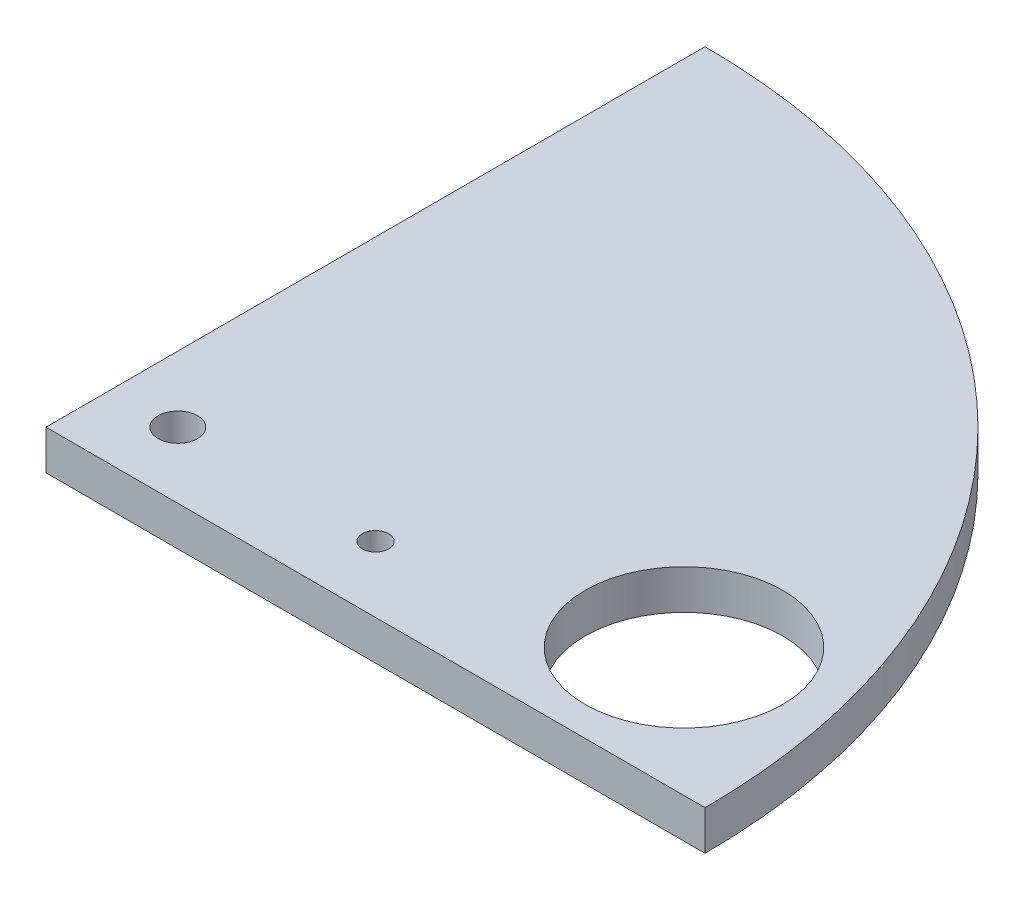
from build123d import *

# Parameters (mm, degrees)
SKETCH1_R           = 7.5
SKETCH1_R_2         = 1.5
SKETCH1_R_3         = 1
BOSS_EXTRUDE1_DEPTH = 3


with BuildPart() as part:
    # Sketch1 → Boss-Extrude1 (new body)
    with BuildSketch(Plane(origin=(0, 0, 0), x_dir=(1, 0, 0), z_dir=(0, 1, 0))):
        with BuildLine():
            Line((0, 0), (0, 50))
            ThreePointArc((0, 50), (35.355339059, 35.355339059), (50, 0))
            Line((50, 0), (0, 0))
        make_face()
        with Locations(Location((38.669114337, 9.731885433, 0), (0, 0, 270))):
            Circle(SKETCH1_R, mode=Mode.SUBTRACT)
        with Locations(Location((5, 5, 0), (0, 0, 270))):
            Circle(SKETCH1_R_2, mode=Mode.SUBTRACT)
        with Locations(Location((20, 5, 0), (0, 0, 270))):
            Circle(SKETCH1_R_3, mode=Mode.SUBTRACT)
    extrude(amount=BOSS_EXTRUDE1_DEPTH)


solid = part.part
